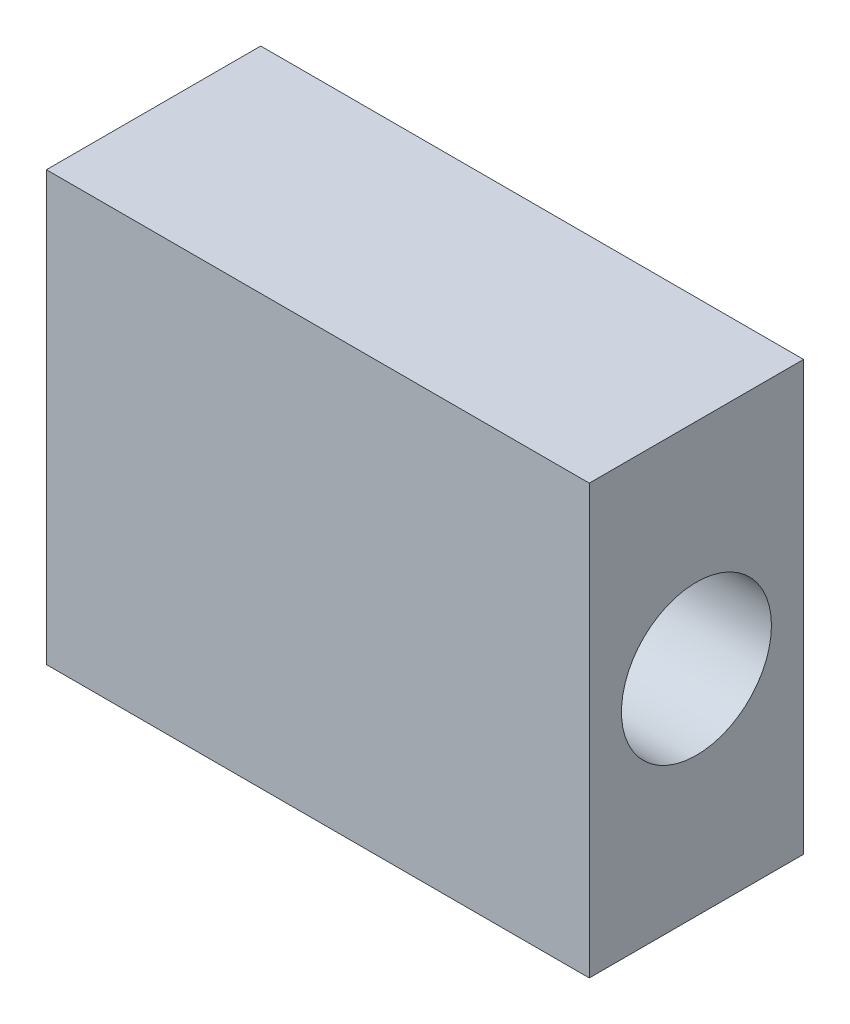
ISO-10303-21;
HEADER;
FILE_DESCRIPTION(('STEP AP214'),'2;1');
FILE_NAME('part.step','',(''),(''),'','','');
FILE_SCHEMA(('AUTOMOTIVE_DESIGN { 1 0 10303 214 1 1 1 1 }'));
ENDSEC;
DATA;
#1=APPLICATION_CONTEXT('core data for automotive mechanical design processes');
#2=APPLICATION_PROTOCOL_DEFINITION('international standard','automotive_design',2000,#1);
#3=PRODUCT_CONTEXT('',#1,'mechanical');
#4=PRODUCT('Part','Part','',(#3));
#5=PRODUCT_RELATED_PRODUCT_CATEGORY('part','',(#4));
#6=PRODUCT_DEFINITION_FORMATION('','',#4);
#7=PRODUCT_DEFINITION_CONTEXT('part definition',#1,'design');
#8=PRODUCT_DEFINITION('design','',#6,#7);
#9=PRODUCT_DEFINITION_SHAPE('','',#8);
#10=(LENGTH_UNIT() NAMED_UNIT(*) SI_UNIT(.MILLI.,.METRE.));
#11=(NAMED_UNIT(*) PLANE_ANGLE_UNIT() SI_UNIT($,.RADIAN.));
#12=(NAMED_UNIT(*) SI_UNIT($,.STERADIAN.) SOLID_ANGLE_UNIT());
#13=UNCERTAINTY_MEASURE_WITH_UNIT(LENGTH_MEASURE(1.E-05),#10,'distance_accuracy_value','');
#14=(GEOMETRIC_REPRESENTATION_CONTEXT(3) GLOBAL_UNCERTAINTY_ASSIGNED_CONTEXT((#13)) GLOBAL_UNIT_ASSIGNED_CONTEXT((#10,
#11,#12)) REPRESENTATION_CONTEXT('',''));
#15=CARTESIAN_POINT('',(0.,0.,0.));
#16=DIRECTION('',(0.,0.,1.));
#17=DIRECTION('',(1.,0.,0.));
#18=AXIS2_PLACEMENT_3D('',#15,#16,#17);
#19=CARTESIAN_POINT('',(0.,0.,15.));
#20=DIRECTION('',(1.,0.,0.));
#21=DIRECTION('',(0.,0.,-1.));
#22=AXIS2_PLACEMENT_3D('',#19,#20,#21);
#23=PLANE('',#22);
#24=DIRECTION('',(0.,-1.,0.));
#25=VECTOR('',#24,1.);
#26=CARTESIAN_POINT('',(0.,0.,0.));
#27=LINE('',#26,#25);
#28=CARTESIAN_POINT('',(0.,30.,0.));
#29=VERTEX_POINT('',#28);
#30=CARTESIAN_POINT('',(0.,0.,0.));
#31=VERTEX_POINT('',#30);
#32=EDGE_CURVE('E82',#29,#31,#27,.T.);
#33=ORIENTED_EDGE('',*,*,#32,.T.);
#34=DIRECTION('',(0.,0.,-1.));
#35=VECTOR('',#34,1.);
#36=CARTESIAN_POINT('',(0.,0.,15.));
#37=LINE('',#36,#35);
#38=CARTESIAN_POINT('',(0.,0.,15.));
#39=VERTEX_POINT('',#38);
#40=EDGE_CURVE('E11',#39,#31,#37,.T.);
#41=ORIENTED_EDGE('',*,*,#40,.F.);
#42=DIRECTION('',(0.,-1.,0.));
#43=VECTOR('',#42,1.);
#44=CARTESIAN_POINT('',(0.,0.,15.));
#45=LINE('',#44,#43);
#46=CARTESIAN_POINT('',(0.,30.,15.));
#47=VERTEX_POINT('',#46);
#48=EDGE_CURVE('E93',#47,#39,#45,.T.);
#49=ORIENTED_EDGE('',*,*,#48,.F.);
#50=DIRECTION('',(0.,0.,-1.));
#51=VECTOR('',#50,1.);
#52=CARTESIAN_POINT('',(0.,30.,15.));
#53=LINE('',#52,#51);
#54=EDGE_CURVE('E99',#47,#29,#53,.T.);
#55=ORIENTED_EDGE('',*,*,#54,.T.);
#56=EDGE_LOOP('',(#33,#41,#49,#55));
#57=FACE_BOUND('',#56,.T.);
#58=ADVANCED_FACE('F29',(#57),#23,.F.);
#59=CARTESIAN_POINT('',(0.,0.,15.));
#60=DIRECTION('',(0.,1.,0.));
#61=DIRECTION('',(0.,0.,1.));
#62=AXIS2_PLACEMENT_3D('',#59,#60,#61);
#63=PLANE('',#62);
#64=DIRECTION('',(1.,0.,0.));
#65=VECTOR('',#64,1.);
#66=CARTESIAN_POINT('',(0.,0.,0.));
#67=LINE('',#66,#65);
#68=CARTESIAN_POINT('',(38.,0.,0.));
#69=VERTEX_POINT('',#68);
#70=EDGE_CURVE('E87',#31,#69,#67,.T.);
#71=ORIENTED_EDGE('',*,*,#70,.T.);
#72=DIRECTION('',(0.,0.,-1.));
#73=VECTOR('',#72,1.);
#74=CARTESIAN_POINT('',(38.,0.,15.));
#75=LINE('',#74,#73);
#76=CARTESIAN_POINT('',(38.,0.,15.));
#77=VERTEX_POINT('',#76);
#78=EDGE_CURVE('E36',#77,#69,#75,.T.);
#79=ORIENTED_EDGE('',*,*,#78,.F.);
#80=DIRECTION('',(1.,0.,0.));
#81=VECTOR('',#80,1.);
#82=CARTESIAN_POINT('',(0.,0.,15.));
#83=LINE('',#82,#81);
#84=EDGE_CURVE('E95',#39,#77,#83,.T.);
#85=ORIENTED_EDGE('',*,*,#84,.F.);
#86=ORIENTED_EDGE('',*,*,#40,.T.);
#87=EDGE_LOOP('',(#71,#79,#85,#86));
#88=FACE_BOUND('',#87,.T.);
#89=ADVANCED_FACE('F120',(#88),#63,.F.);
#90=CARTESIAN_POINT('',(38.,0.,15.));
#91=DIRECTION('',(-1.,0.,0.));
#92=DIRECTION('',(0.,0.,1.));
#93=AXIS2_PLACEMENT_3D('',#90,#91,#92);
#94=PLANE('',#93);
#95=CARTESIAN_POINT('',(38.,15.,7.5));
#96=DIRECTION('',(1.,0.,0.));
#97=DIRECTION('',(0.,0.,-1.));
#98=AXIS2_PLACEMENT_3D('',#95,#96,#97);
#99=CIRCLE('',#98,5.25);
#100=CARTESIAN_POINT('',(38.,15.,2.25));
#101=VERTEX_POINT('',#100);
#102=EDGE_CURVE('E79',#101,#101,#99,.T.);
#103=ORIENTED_EDGE('',*,*,#102,.F.);
#104=EDGE_LOOP('',(#103));
#105=FACE_BOUND('',#104,.T.);
#106=DIRECTION('',(0.,1.,0.));
#107=VECTOR('',#106,1.);
#108=CARTESIAN_POINT('',(38.,0.,0.));
#109=LINE('',#108,#107);
#110=CARTESIAN_POINT('',(38.,30.,0.));
#111=VERTEX_POINT('',#110);
#112=EDGE_CURVE('E89',#69,#111,#109,.T.);
#113=ORIENTED_EDGE('',*,*,#112,.T.);
#114=DIRECTION('',(0.,0.,-1.));
#115=VECTOR('',#114,1.);
#116=CARTESIAN_POINT('',(38.,30.,15.));
#117=LINE('',#116,#115);
#118=CARTESIAN_POINT('',(38.,30.,15.));
#119=VERTEX_POINT('',#118);
#120=EDGE_CURVE('E102',#119,#111,#117,.T.);
#121=ORIENTED_EDGE('',*,*,#120,.F.);
#122=DIRECTION('',(0.,1.,0.));
#123=VECTOR('',#122,1.);
#124=CARTESIAN_POINT('',(38.,0.,15.));
#125=LINE('',#124,#123);
#126=EDGE_CURVE('E48',#77,#119,#125,.T.);
#127=ORIENTED_EDGE('',*,*,#126,.F.);
#128=ORIENTED_EDGE('',*,*,#78,.T.);
#129=EDGE_LOOP('',(#113,#121,#127,#128));
#130=FACE_BOUND('',#129,.T.);
#131=ADVANCED_FACE('F108',(#105,#130),#94,.F.);
#132=CARTESIAN_POINT('',(0.,30.,15.));
#133=DIRECTION('',(0.,-1.,0.));
#134=DIRECTION('',(0.,0.,-1.));
#135=AXIS2_PLACEMENT_3D('',#132,#133,#134);
#136=PLANE('',#135);
#137=DIRECTION('',(-1.,0.,0.));
#138=VECTOR('',#137,1.);
#139=CARTESIAN_POINT('',(0.,30.,0.));
#140=LINE('',#139,#138);
#141=EDGE_CURVE('E91',#111,#29,#140,.T.);
#142=ORIENTED_EDGE('',*,*,#141,.T.);
#143=ORIENTED_EDGE('',*,*,#54,.F.);
#144=DIRECTION('',(-1.,0.,0.));
#145=VECTOR('',#144,1.);
#146=CARTESIAN_POINT('',(0.,30.,15.));
#147=LINE('',#146,#145);
#148=EDGE_CURVE('E43',#119,#47,#147,.T.);
#149=ORIENTED_EDGE('',*,*,#148,.F.);
#150=ORIENTED_EDGE('',*,*,#120,.T.);
#151=EDGE_LOOP('',(#142,#143,#149,#150));
#152=FACE_BOUND('',#151,.T.);
#153=ADVANCED_FACE('F115',(#152),#136,.F.);
#154=CARTESIAN_POINT('',(0.,30.,15.));
#155=DIRECTION('',(0.,0.,-1.));
#156=DIRECTION('',(-1.,0.,0.));
#157=AXIS2_PLACEMENT_3D('',#154,#155,#156);
#158=PLANE('',#157);
#159=ORIENTED_EDGE('',*,*,#48,.T.);
#160=ORIENTED_EDGE('',*,*,#84,.T.);
#161=ORIENTED_EDGE('',*,*,#126,.T.);
#162=ORIENTED_EDGE('',*,*,#148,.T.);
#163=EDGE_LOOP('',(#159,#160,#161,#162));
#164=FACE_BOUND('',#163,.T.);
#165=ADVANCED_FACE('F119',(#164),#158,.F.);
#166=CARTESIAN_POINT('',(0.,30.,0.));
#167=DIRECTION('',(0.,0.,-1.));
#168=DIRECTION('',(-1.,0.,0.));
#169=AXIS2_PLACEMENT_3D('',#166,#167,#168);
#170=PLANE('',#169);
#171=ORIENTED_EDGE('',*,*,#32,.F.);
#172=ORIENTED_EDGE('',*,*,#141,.F.);
#173=ORIENTED_EDGE('',*,*,#112,.F.);
#174=ORIENTED_EDGE('',*,*,#70,.F.);
#175=EDGE_LOOP('',(#171,#172,#173,#174));
#176=FACE_BOUND('',#175,.T.);
#177=ADVANCED_FACE('F113',(#176),#170,.T.);
#178=CARTESIAN_POINT('',(38.,15.,7.5));
#179=DIRECTION('',(1.,0.,0.));
#180=DIRECTION('',(0.,0.,-1.));
#181=AXIS2_PLACEMENT_3D('',#178,#179,#180);
#182=CYLINDRICAL_SURFACE('',#181,5.25);
#183=CARTESIAN_POINT('',(11.5,15.,7.5));
#184=DIRECTION('',(1.,0.,0.));
#185=DIRECTION('',(0.,0.,-1.));
#186=AXIS2_PLACEMENT_3D('',#183,#184,#185);
#187=CIRCLE('',#186,5.24999999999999);
#188=CARTESIAN_POINT('',(11.5,15.,2.25000000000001));
#189=VERTEX_POINT('',#188);
#190=EDGE_CURVE('E77',#189,#189,#187,.T.);
#191=ORIENTED_EDGE('',*,*,#190,.F.);
#192=EDGE_LOOP('',(#191));
#193=FACE_BOUND('',#192,.T.);
#194=ORIENTED_EDGE('',*,*,#102,.T.);
#195=EDGE_LOOP('',(#194));
#196=FACE_BOUND('',#195,.T.);
#197=ADVANCED_FACE('F73',(#193,#196),#182,.F.);
#198=CARTESIAN_POINT('',(11.5,15.,7.5));
#199=DIRECTION('',(1.,0.,0.));
#200=DIRECTION('',(0.,0.,-1.));
#201=AXIS2_PLACEMENT_3D('',#198,#199,#200);
#202=CONICAL_SURFACE('',#201,5.24999999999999,1.02974425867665);
#203=CARTESIAN_POINT('',(8.34548175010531,15.,7.5));
#204=VERTEX_POINT('',#203);
#205=VERTEX_LOOP('',#204);
#206=FACE_BOUND('',#205,.T.);
#207=ORIENTED_EDGE('',*,*,#190,.T.);
#208=EDGE_LOOP('',(#207));
#209=FACE_BOUND('',#208,.T.);
#210=ADVANCED_FACE('F70',(#206,#209),#202,.F.);
#211=CLOSED_SHELL('',(#58,#89,#131,#153,#165,#177,#197,#210));
#212=MANIFOLD_SOLID_BREP('B2',#211);
#213=ADVANCED_BREP_SHAPE_REPRESENTATION('',(#18,#212),#14);
#214=SHAPE_DEFINITION_REPRESENTATION(#9,#213);
ENDSEC;
END-ISO-10303-21;
